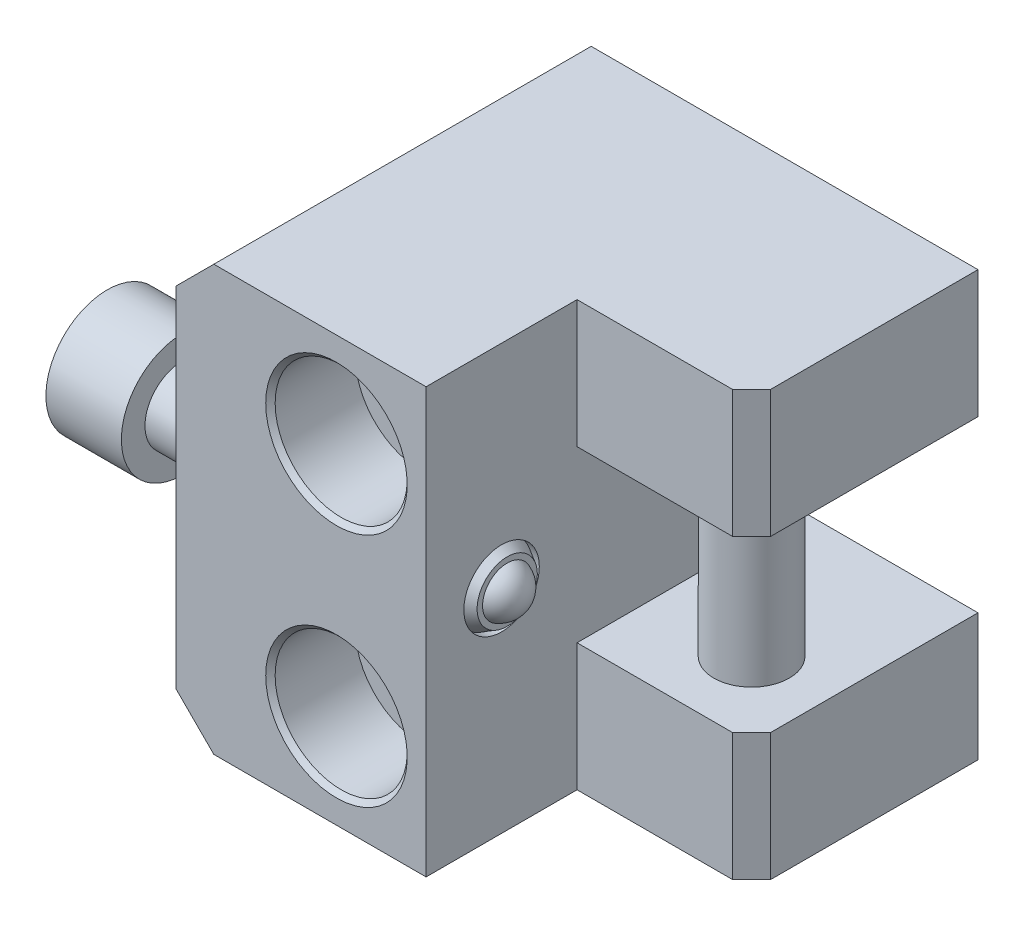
ISO-10303-21;
HEADER;
FILE_DESCRIPTION(('STEP AP214'),'2;1');
FILE_NAME('part.step','',(''),(''),'','','');
FILE_SCHEMA(('AUTOMOTIVE_DESIGN { 1 0 10303 214 1 1 1 1 }'));
ENDSEC;
DATA;
#1=APPLICATION_CONTEXT('core data for automotive mechanical design processes');
#2=APPLICATION_PROTOCOL_DEFINITION('international standard','automotive_design',2000,#1);
#3=PRODUCT_CONTEXT('',#1,'mechanical');
#4=PRODUCT('Part','Part','',(#3));
#5=PRODUCT_RELATED_PRODUCT_CATEGORY('part','',(#4));
#6=PRODUCT_DEFINITION_FORMATION('','',#4);
#7=PRODUCT_DEFINITION_CONTEXT('part definition',#1,'design');
#8=PRODUCT_DEFINITION('design','',#6,#7);
#9=PRODUCT_DEFINITION_SHAPE('','',#8);
#10=(LENGTH_UNIT() NAMED_UNIT(*) SI_UNIT(.MILLI.,.METRE.));
#11=(NAMED_UNIT(*) PLANE_ANGLE_UNIT() SI_UNIT($,.RADIAN.));
#12=(NAMED_UNIT(*) SI_UNIT($,.STERADIAN.) SOLID_ANGLE_UNIT());
#13=UNCERTAINTY_MEASURE_WITH_UNIT(LENGTH_MEASURE(1.E-05),#10,'distance_accuracy_value','');
#14=(GEOMETRIC_REPRESENTATION_CONTEXT(3) GLOBAL_UNCERTAINTY_ASSIGNED_CONTEXT((#13)) GLOBAL_UNIT_ASSIGNED_CONTEXT((#10,
#11,#12)) REPRESENTATION_CONTEXT('',''));
#15=CARTESIAN_POINT('',(0.,0.,0.));
#16=DIRECTION('',(0.,0.,1.));
#17=DIRECTION('',(1.,0.,0.));
#18=AXIS2_PLACEMENT_3D('',#15,#16,#17);
#19=CARTESIAN_POINT('',(-28.3000000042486,10.3571350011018,26.3957043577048));
#20=DIRECTION('',(-1.,-4.10206958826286E-10,0.));
#21=DIRECTION('',(-1.46502879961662E-10,0.357144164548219,0.934049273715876));
#22=AXIS2_PLACEMENT_3D('',#19,#20,#21);
#23=PLANE('',#22);
#24=DIRECTION('',(6.47014759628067E-11,-0.157728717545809,0.987482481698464));
#25=VECTOR('',#24,1.);
#26=CARTESIAN_POINT('',(-28.3000000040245,9.81074669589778,29.8164440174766));
#27=LINE('',#26,#25);
#28=CARTESIAN_POINT('',(-28.3000000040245,9.81074669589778,29.8164440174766));
#29=VERTEX_POINT('',#28);
#30=CARTESIAN_POINT('',(-28.3000000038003,9.26435839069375,33.2371836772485));
#31=VERTEX_POINT('',#30);
#32=EDGE_CURVE('E371',#29,#31,#27,.T.);
#33=ORIENTED_EDGE('',*,*,#32,.T.);
#34=DIRECTION('',(3.18451907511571E-10,-0.776320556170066,-0.630338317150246));
#35=VECTOR('',#34,1.);
#36=CARTESIAN_POINT('',(-28.3000000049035,11.9536116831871,35.4207396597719));
#37=LINE('',#36,#35);
#38=CARTESIAN_POINT('',(-28.3000000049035,11.9536116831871,35.4207396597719));
#39=VERTEX_POINT('',#38);
#40=EDGE_CURVE('E373',#39,#31,#37,.T.);
#41=ORIENTED_EDGE('',*,*,#40,.F.);
#42=DIRECTION('',(3.83153383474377E-10,-0.934049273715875,0.35714416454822));
#43=VECTOR('',#42,1.);
#44=CARTESIAN_POINT('',(-28.3000000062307,15.1892532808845,34.1835559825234));
#45=LINE('',#44,#43);
#46=CARTESIAN_POINT('',(-28.3000000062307,15.1892532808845,34.1835559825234));
#47=VERTEX_POINT('',#46);
#48=EDGE_CURVE('E376',#47,#39,#45,.T.);
#49=ORIENTED_EDGE('',*,*,#48,.F.);
#50=DIRECTION('',(-6.47014759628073E-11,0.157728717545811,-0.987482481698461));
#51=VECTOR('',#50,1.);
#52=CARTESIAN_POINT('',(-28.3000000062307,15.1892532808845,34.1835559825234));
#53=LINE('',#52,#51);
#54=CARTESIAN_POINT('',(-28.3000000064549,15.7356415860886,30.7628163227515));
#55=VERTEX_POINT('',#54);
#56=EDGE_CURVE('E182',#47,#55,#53,.T.);
#57=ORIENTED_EDGE('',*,*,#56,.T.);
#58=DIRECTION('',(-3.1845190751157E-10,0.776320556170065,0.630338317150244));
#59=VECTOR('',#58,1.);
#60=CARTESIAN_POINT('',(-28.3000000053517,13.0463882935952,28.5792603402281));
#61=LINE('',#60,#59);
#62=CARTESIAN_POINT('',(-28.3000000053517,13.0463882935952,28.5792603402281));
#63=VERTEX_POINT('',#62);
#64=EDGE_CURVE('E165',#63,#55,#61,.T.);
#65=ORIENTED_EDGE('',*,*,#64,.F.);
#66=DIRECTION('',(3.83153383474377E-10,-0.934049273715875,0.35714416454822));
#67=VECTOR('',#66,1.);
#68=CARTESIAN_POINT('',(-28.3000000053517,13.0463882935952,28.5792603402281));
#69=LINE('',#68,#67);
#70=EDGE_CURVE('E179',#63,#29,#69,.T.);
#71=ORIENTED_EDGE('',*,*,#70,.T.);
#72=EDGE_LOOP('',(#33,#41,#49,#57,#65,#71));
#73=FACE_BOUND('',#72,.T.);
#74=ADVANCED_FACE('F14',(#73),#23,.T.);
#75=CARTESIAN_POINT('',(-28.3000000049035,11.9536116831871,35.4207396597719));
#76=DIRECTION('',(-2.58569123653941E-10,0.630338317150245,-0.776320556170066));
#77=DIRECTION('',(-3.18451907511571E-10,0.776320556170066,0.630338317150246));
#78=AXIS2_PLACEMENT_3D('',#75,#76,#77);
#79=PLANE('',#78);
#80=ORIENTED_EDGE('',*,*,#40,.T.);
#81=DIRECTION('',(-1.,-4.10206958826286E-10,0.));
#82=VECTOR('',#81,1.);
#83=CARTESIAN_POINT('',(-28.3000000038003,9.26435839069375,33.2371836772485));
#84=LINE('',#83,#82);
#85=CARTESIAN_POINT('',(-32.3000000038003,9.26435838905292,33.2371836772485));
#86=VERTEX_POINT('',#85);
#87=EDGE_CURVE('E186',#31,#86,#84,.T.);
#88=ORIENTED_EDGE('',*,*,#87,.T.);
#89=DIRECTION('',(3.18451907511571E-10,-0.776320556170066,-0.630338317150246));
#90=VECTOR('',#89,1.);
#91=CARTESIAN_POINT('',(-32.3000000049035,11.9536116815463,35.4207396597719));
#92=LINE('',#91,#90);
#93=CARTESIAN_POINT('',(-32.3000000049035,11.9536116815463,35.4207396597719));
#94=VERTEX_POINT('',#93);
#95=EDGE_CURVE('E357',#94,#86,#92,.T.);
#96=ORIENTED_EDGE('',*,*,#95,.F.);
#97=DIRECTION('',(-1.,-4.10206958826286E-10,0.));
#98=VECTOR('',#97,1.);
#99=CARTESIAN_POINT('',(-28.3000000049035,11.9536116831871,35.4207396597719));
#100=LINE('',#99,#98);
#101=EDGE_CURVE('E136',#39,#94,#100,.T.);
#102=ORIENTED_EDGE('',*,*,#101,.F.);
#103=EDGE_LOOP('',(#80,#88,#96,#102));
#104=FACE_BOUND('',#103,.T.);
#105=ADVANCED_FACE('F386',(#104),#79,.T.);
#106=CARTESIAN_POINT('',(-28.3000000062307,15.1892532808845,34.1835559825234));
#107=DIRECTION('',(1.46502879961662E-10,-0.35714416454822,-0.934049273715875));
#108=DIRECTION('',(-3.83153383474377E-10,0.934049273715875,-0.35714416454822));
#109=AXIS2_PLACEMENT_3D('',#106,#107,#108);
#110=PLANE('',#109);
#111=ORIENTED_EDGE('',*,*,#101,.T.);
#112=DIRECTION('',(3.83153383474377E-10,-0.934049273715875,0.35714416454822));
#113=VECTOR('',#112,1.);
#114=CARTESIAN_POINT('',(-32.3000000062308,15.1892532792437,34.1835559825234));
#115=LINE('',#114,#113);
#116=CARTESIAN_POINT('',(-32.3000000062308,15.1892532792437,34.1835559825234));
#117=VERTEX_POINT('',#116);
#118=EDGE_CURVE('E360',#117,#94,#115,.T.);
#119=ORIENTED_EDGE('',*,*,#118,.F.);
#120=DIRECTION('',(-1.,-4.10206958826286E-10,0.));
#121=VECTOR('',#120,1.);
#122=CARTESIAN_POINT('',(-28.3000000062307,15.1892532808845,34.1835559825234));
#123=LINE('',#122,#121);
#124=EDGE_CURVE('E192',#47,#117,#123,.T.);
#125=ORIENTED_EDGE('',*,*,#124,.F.);
#126=ORIENTED_EDGE('',*,*,#48,.T.);
#127=EDGE_LOOP('',(#111,#119,#125,#126));
#128=FACE_BOUND('',#127,.T.);
#129=ADVANCED_FACE('F377',(#128),#110,.T.);
#130=CARTESIAN_POINT('',(-28.3000000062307,15.1892532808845,34.1835559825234));
#131=DIRECTION('',(-4.05072003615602E-10,0.987482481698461,0.157728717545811));
#132=DIRECTION('',(6.47014759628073E-11,-0.157728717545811,0.987482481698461));
#133=AXIS2_PLACEMENT_3D('',#130,#131,#132);
#134=PLANE('',#133);
#135=ORIENTED_EDGE('',*,*,#124,.T.);
#136=DIRECTION('',(-6.47014759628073E-11,0.157728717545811,-0.987482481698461));
#137=VECTOR('',#136,1.);
#138=CARTESIAN_POINT('',(-32.3000000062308,15.1892532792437,34.1835559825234));
#139=LINE('',#138,#137);
#140=CARTESIAN_POINT('',(-32.3000000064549,15.7356415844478,30.7628163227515));
#141=VERTEX_POINT('',#140);
#142=EDGE_CURVE('E365',#117,#141,#139,.T.);
#143=ORIENTED_EDGE('',*,*,#142,.T.);
#144=DIRECTION('',(-1.,-4.10206958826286E-10,0.));
#145=VECTOR('',#144,1.);
#146=CARTESIAN_POINT('',(-28.3000000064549,15.7356415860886,30.7628163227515));
#147=LINE('',#146,#145);
#148=EDGE_CURVE('E173',#55,#141,#147,.T.);
#149=ORIENTED_EDGE('',*,*,#148,.F.);
#150=ORIENTED_EDGE('',*,*,#56,.F.);
#151=EDGE_LOOP('',(#135,#143,#149,#150));
#152=FACE_BOUND('',#151,.T.);
#153=ADVANCED_FACE('F380',(#152),#134,.F.);
#154=CARTESIAN_POINT('',(-28.3000000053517,13.0463882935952,28.5792603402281));
#155=DIRECTION('',(2.58569123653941E-10,-0.630338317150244,0.776320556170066));
#156=DIRECTION('',(3.1845190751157E-10,-0.776320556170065,-0.630338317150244));
#157=AXIS2_PLACEMENT_3D('',#154,#155,#156);
#158=PLANE('',#157);
#159=ORIENTED_EDGE('',*,*,#148,.T.);
#160=DIRECTION('',(-3.1845190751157E-10,0.776320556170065,0.630338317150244));
#161=VECTOR('',#160,1.);
#162=CARTESIAN_POINT('',(-32.3000000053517,13.0463882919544,28.5792603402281));
#163=LINE('',#162,#161);
#164=CARTESIAN_POINT('',(-32.3000000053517,13.0463882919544,28.5792603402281));
#165=VERTEX_POINT('',#164);
#166=EDGE_CURVE('E167',#165,#141,#163,.T.);
#167=ORIENTED_EDGE('',*,*,#166,.F.);
#168=DIRECTION('',(-1.,-4.10206958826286E-10,0.));
#169=VECTOR('',#168,1.);
#170=CARTESIAN_POINT('',(-28.3000000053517,13.0463882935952,28.5792603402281));
#171=LINE('',#170,#169);
#172=EDGE_CURVE('E162',#63,#165,#171,.T.);
#173=ORIENTED_EDGE('',*,*,#172,.F.);
#174=ORIENTED_EDGE('',*,*,#64,.T.);
#175=EDGE_LOOP('',(#159,#167,#173,#174));
#176=FACE_BOUND('',#175,.T.);
#177=ADVANCED_FACE('F164',(#176),#158,.T.);
#178=CARTESIAN_POINT('',(-28.3000000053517,13.0463882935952,28.5792603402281));
#179=DIRECTION('',(1.46502879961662E-10,-0.35714416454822,-0.934049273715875));
#180=DIRECTION('',(-3.83153383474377E-10,0.934049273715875,-0.35714416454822));
#181=AXIS2_PLACEMENT_3D('',#178,#179,#180);
#182=PLANE('',#181);
#183=ORIENTED_EDGE('',*,*,#172,.T.);
#184=DIRECTION('',(3.83153383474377E-10,-0.934049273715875,0.35714416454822));
#185=VECTOR('',#184,1.);
#186=CARTESIAN_POINT('',(-32.3000000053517,13.0463882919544,28.5792603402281));
#187=LINE('',#186,#185);
#188=CARTESIAN_POINT('',(-32.3000000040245,9.81074669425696,29.8164440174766));
#189=VERTEX_POINT('',#188);
#190=EDGE_CURVE('E369',#165,#189,#187,.T.);
#191=ORIENTED_EDGE('',*,*,#190,.T.);
#192=DIRECTION('',(-1.,-4.10206958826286E-10,0.));
#193=VECTOR('',#192,1.);
#194=CARTESIAN_POINT('',(-28.3000000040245,9.81074669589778,29.8164440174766));
#195=LINE('',#194,#193);
#196=EDGE_CURVE('E172',#29,#189,#195,.T.);
#197=ORIENTED_EDGE('',*,*,#196,.F.);
#198=ORIENTED_EDGE('',*,*,#70,.F.);
#199=EDGE_LOOP('',(#183,#191,#197,#198));
#200=FACE_BOUND('',#199,.T.);
#201=ADVANCED_FACE('F184',(#200),#182,.F.);
#202=CARTESIAN_POINT('',(-28.3000000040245,9.81074669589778,29.8164440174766));
#203=DIRECTION('',(4.05072003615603E-10,-0.987482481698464,-0.157728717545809));
#204=DIRECTION('',(-6.47014759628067E-11,0.157728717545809,-0.987482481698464));
#205=AXIS2_PLACEMENT_3D('',#202,#203,#204);
#206=PLANE('',#205);
#207=ORIENTED_EDGE('',*,*,#196,.T.);
#208=DIRECTION('',(6.47014759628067E-11,-0.157728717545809,0.987482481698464));
#209=VECTOR('',#208,1.);
#210=CARTESIAN_POINT('',(-32.3000000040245,9.81074669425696,29.8164440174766));
#211=LINE('',#210,#209);
#212=EDGE_CURVE('E33',#189,#86,#211,.T.);
#213=ORIENTED_EDGE('',*,*,#212,.T.);
#214=ORIENTED_EDGE('',*,*,#87,.F.);
#215=ORIENTED_EDGE('',*,*,#32,.F.);
#216=EDGE_LOOP('',(#207,#213,#214,#215));
#217=FACE_BOUND('',#216,.T.);
#218=ADVANCED_FACE('F387',(#217),#206,.F.);
#219=CARTESIAN_POINT('',(-32.3000000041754,10.178562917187,25.9286797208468));
#220=DIRECTION('',(-1.,-4.10206958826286E-10,0.));
#221=DIRECTION('',(-1.46502879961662E-10,0.357144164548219,0.934049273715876));
#222=AXIS2_PLACEMENT_3D('',#219,#220,#221);
#223=PLANE('',#222);
#224=ORIENTED_EDGE('',*,*,#212,.F.);
#225=ORIENTED_EDGE('',*,*,#190,.F.);
#226=ORIENTED_EDGE('',*,*,#166,.T.);
#227=ORIENTED_EDGE('',*,*,#142,.F.);
#228=ORIENTED_EDGE('',*,*,#118,.T.);
#229=ORIENTED_EDGE('',*,*,#95,.T.);
#230=EDGE_LOOP('',(#224,#225,#226,#227,#228,#229));
#231=FACE_BOUND('',#230,.T.);
#232=CARTESIAN_POINT('',(-32.3000000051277,12.4999999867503,32.));
#233=DIRECTION('',(1.,4.10206958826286E-10,0.));
#234=DIRECTION('',(1.46502879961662E-10,-0.357144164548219,-0.934049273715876));
#235=AXIS2_PLACEMENT_3D('',#232,#233,#234);
#236=CIRCLE('',#235,6.5);
#237=CARTESIAN_POINT('',(-32.3000000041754,10.1785629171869,25.9286797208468));
#238=VERTEX_POINT('',#237);
#239=EDGE_CURVE('E196',#238,#238,#236,.T.);
#240=ORIENTED_EDGE('',*,*,#239,.F.);
#241=EDGE_LOOP('',(#240));
#242=FACE_BOUND('',#241,.T.);
#243=ADVANCED_FACE('F383',(#231,#242),#223,.T.);
#244=CARTESIAN_POINT('',(5.69999999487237,12.5000000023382,32.));
#245=DIRECTION('',(1.,4.10206958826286E-10,0.));
#246=DIRECTION('',(1.46502879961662E-10,-0.357144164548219,-0.934049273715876));
#247=AXIS2_PLACEMENT_3D('',#244,#245,#246);
#248=CYLINDRICAL_SURFACE('',#247,6.5);
#249=ORIENTED_EDGE('',*,*,#239,.T.);
#250=EDGE_LOOP('',(#249));
#251=FACE_BOUND('',#250,.T.);
#252=CARTESIAN_POINT('',(-24.3000000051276,12.499999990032,32.));
#253=DIRECTION('',(1.,4.10206958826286E-10,0.));
#254=DIRECTION('',(1.46502879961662E-10,-0.357144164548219,-0.934049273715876));
#255=AXIS2_PLACEMENT_3D('',#252,#253,#254);
#256=CIRCLE('',#255,6.5);
#257=CARTESIAN_POINT('',(-24.3000000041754,10.1785629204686,25.9286797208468));
#258=VERTEX_POINT('',#257);
#259=EDGE_CURVE('E199',#258,#258,#256,.T.);
#260=ORIENTED_EDGE('',*,*,#259,.F.);
#261=EDGE_LOOP('',(#260));
#262=FACE_BOUND('',#261,.T.);
#263=ADVANCED_FACE('F396',(#251,#262),#248,.T.);
#264=CARTESIAN_POINT('',(-24.3000000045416,11.0714233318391,28.2638029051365));
#265=DIRECTION('',(1.,4.10206958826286E-10,0.));
#266=DIRECTION('',(1.46502879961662E-10,-0.357144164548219,-0.934049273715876));
#267=AXIS2_PLACEMENT_3D('',#264,#265,#266);
#268=PLANE('',#267);
#269=ORIENTED_EDGE('',*,*,#259,.T.);
#270=EDGE_LOOP('',(#269));
#271=FACE_BOUND('',#270,.T.);
#272=CARTESIAN_POINT('',(-24.3000000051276,12.499999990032,32.));
#273=DIRECTION('',(1.,4.10206958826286E-10,0.));
#274=DIRECTION('',(1.46502879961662E-10,-0.357144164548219,-0.934049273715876));
#275=AXIS2_PLACEMENT_3D('',#272,#273,#274);
#276=CIRCLE('',#275,4.);
#277=CARTESIAN_POINT('',(-24.3000000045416,11.0714233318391,28.2638029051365));
#278=VERTEX_POINT('',#277);
#279=EDGE_CURVE('E202',#278,#278,#276,.T.);
#280=ORIENTED_EDGE('',*,*,#279,.F.);
#281=EDGE_LOOP('',(#280));
#282=FACE_BOUND('',#281,.T.);
#283=ADVANCED_FACE('F751',(#271,#282),#268,.T.);
#284=CARTESIAN_POINT('',(5.69999999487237,12.5000000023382,32.));
#285=DIRECTION('',(1.,4.10206958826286E-10,0.));
#286=DIRECTION('',(1.46502879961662E-10,-0.357144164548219,-0.934049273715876));
#287=AXIS2_PLACEMENT_3D('',#284,#285,#286);
#288=CYLINDRICAL_SURFACE('',#287,4.);
#289=ORIENTED_EDGE('',*,*,#279,.T.);
#290=EDGE_LOOP('',(#289));
#291=FACE_BOUND('',#290,.T.);
#292=CARTESIAN_POINT('',(-17.0000000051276,12.4999999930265,32.));
#293=DIRECTION('',(1.,4.10207011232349E-10,0.));
#294=DIRECTION('',(-4.10207011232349E-10,1.,0.));
#295=AXIS2_PLACEMENT_3D('',#292,#293,#294);
#296=CIRCLE('',#295,4.);
#297=CARTESIAN_POINT('',(-17.0000000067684,16.4999999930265,32.));
#298=VERTEX_POINT('',#297);
#299=EDGE_CURVE('E9',#298,#298,#296,.T.);
#300=ORIENTED_EDGE('',*,*,#299,.F.);
#301=EDGE_LOOP('',(#300));
#302=FACE_BOUND('',#301,.T.);
#303=ADVANCED_FACE('F743',(#291,#302),#288,.T.);
#304=CARTESIAN_POINT('',(9.24999999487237,12.5000000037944,32.));
#305=DIRECTION('',(1.,4.10206958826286E-10,0.));
#306=DIRECTION('',(1.46502879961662E-10,-0.357144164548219,-0.934049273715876));
#307=AXIS2_PLACEMENT_3D('',#304,#305,#306);
#308=SPHERICAL_SURFACE('',#307,2.75);
#309=CARTESIAN_POINT('',(10.0983426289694,12.5000000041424,32.));
#310=DIRECTION('',(1.,4.10206958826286E-10,0.));
#311=DIRECTION('',(1.46502879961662E-10,-0.357144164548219,-0.934049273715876));
#312=AXIS2_PLACEMENT_3D('',#309,#310,#311);
#313=CIRCLE('',#312,2.61587743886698);
#314=CARTESIAN_POINT('',(10.0983426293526,11.5657546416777,29.5566415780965));
#315=VERTEX_POINT('',#314);
#316=EDGE_CURVE('E24',#315,#315,#313,.T.);
#317=ORIENTED_EDGE('',*,*,#316,.T.);
#318=EDGE_LOOP('',(#317));
#319=FACE_BOUND('',#318,.T.);
#320=ADVANCED_FACE('F735',(#319),#308,.T.);
#321=CARTESIAN_POINT('',(10.098342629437,11.3600995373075,29.0187859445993));
#322=DIRECTION('',(-1.,-4.10206958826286E-10,0.));
#323=DIRECTION('',(-1.46502879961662E-10,0.357144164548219,0.934049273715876));
#324=AXIS2_PLACEMENT_3D('',#321,#322,#323);
#325=PLANE('',#324);
#326=ORIENTED_EDGE('',*,*,#316,.F.);
#327=EDGE_LOOP('',(#326));
#328=FACE_BOUND('',#327,.T.);
#329=CARTESIAN_POINT('',(10.0983426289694,12.5000000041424,32.));
#330=DIRECTION('',(1.,4.10206958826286E-10,0.));
#331=DIRECTION('',(1.46502879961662E-10,-0.357144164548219,-0.934049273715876));
#332=AXIS2_PLACEMENT_3D('',#329,#330,#331);
#333=CIRCLE('',#332,3.19170962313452);
#334=CARTESIAN_POINT('',(10.098342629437,11.3600995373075,29.0187859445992));
#335=VERTEX_POINT('',#334);
#336=EDGE_CURVE('E208',#335,#335,#333,.T.);
#337=ORIENTED_EDGE('',*,*,#336,.T.);
#338=EDGE_LOOP('',(#337));
#339=FACE_BOUND('',#338,.T.);
#340=ADVANCED_FACE('F416',(#328,#339),#325,.F.);
#341=CARTESIAN_POINT('',(8.69834262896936,12.5000000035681,32.));
#342=DIRECTION('',(-1.,-4.10206958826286E-10,0.));
#343=DIRECTION('',(-1.46502879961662E-10,0.357144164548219,0.934049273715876));
#344=AXIS2_PLACEMENT_3D('',#341,#342,#343);
#345=CONICAL_SURFACE('',#344,4.,0.523598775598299);
#346=ORIENTED_EDGE('',*,*,#336,.F.);
#347=EDGE_LOOP('',(#346));
#348=FACE_BOUND('',#347,.T.);
#349=CARTESIAN_POINT('',(8.69834262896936,12.5000000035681,32.));
#350=DIRECTION('',(1.,4.10206958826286E-10,0.));
#351=DIRECTION('',(1.46502879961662E-10,-0.357144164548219,-0.934049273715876));
#352=AXIS2_PLACEMENT_3D('',#349,#350,#351);
#353=CIRCLE('',#352,4.);
#354=CARTESIAN_POINT('',(8.69834262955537,11.0714233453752,28.2638029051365));
#355=VERTEX_POINT('',#354);
#356=EDGE_CURVE('E205',#355,#355,#353,.T.);
#357=ORIENTED_EDGE('',*,*,#356,.T.);
#358=EDGE_LOOP('',(#357));
#359=FACE_BOUND('',#358,.T.);
#360=ADVANCED_FACE('F404',(#348,#359),#345,.T.);
#361=CARTESIAN_POINT('',(-7.00000001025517,24.9999999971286,30.997116));
#362=DIRECTION('',(0.,0.,-1.));
#363=DIRECTION('',(1.,4.10206857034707E-10,0.));
#364=AXIS2_PLACEMENT_3D('',#361,#362,#363);
#365=PLANE('',#364);
#366=CARTESIAN_POINT('',(-1.0255171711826E-08,25.,30.997116));
#367=DIRECTION('',(0.,0.,1.));
#368=DIRECTION('',(-1.,-4.10206857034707E-10,0.));
#369=AXIS2_PLACEMENT_3D('',#366,#367,#368);
#370=CIRCLE('',#369,4.25);
#371=CARTESIAN_POINT('',(-4.25000001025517,24.9999999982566,30.997116));
#372=VERTEX_POINT('',#371);
#373=EDGE_CURVE('E269',#372,#372,#370,.T.);
#374=ORIENTED_EDGE('',*,*,#373,.F.);
#375=EDGE_LOOP('',(#374));
#376=FACE_BOUND('',#375,.T.);
#377=CARTESIAN_POINT('',(-1.0255171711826E-08,25.,30.997116));
#378=DIRECTION('',(0.,0.,1.));
#379=DIRECTION('',(-1.,-4.10206857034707E-10,0.));
#380=AXIS2_PLACEMENT_3D('',#377,#378,#379);
#381=CIRCLE('',#380,7.);
#382=CARTESIAN_POINT('',(-7.00000001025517,24.9999999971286,30.997116));
#383=VERTEX_POINT('',#382);
#384=EDGE_CURVE('E266',#383,#383,#381,.T.);
#385=ORIENTED_EDGE('',*,*,#384,.T.);
#386=EDGE_LOOP('',(#385));
#387=FACE_BOUND('',#386,.T.);
#388=ADVANCED_FACE('F401',(#376,#387),#365,.F.);
#389=CARTESIAN_POINT('',(-7.,-2.87144093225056E-09,30.997116));
#390=DIRECTION('',(0.,0.,-1.));
#391=DIRECTION('',(1.,4.10206857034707E-10,0.));
#392=AXIS2_PLACEMENT_3D('',#389,#390,#391);
#393=PLANE('',#392);
#394=CARTESIAN_POINT('',(0.,0.,30.997116));
#395=DIRECTION('',(0.,0.,1.));
#396=DIRECTION('',(-1.,-4.10206857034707E-10,0.));
#397=AXIS2_PLACEMENT_3D('',#394,#395,#396);
#398=CIRCLE('',#397,4.25);
#399=CARTESIAN_POINT('',(-4.25,-1.7433722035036E-09,30.997116));
#400=VERTEX_POINT('',#399);
#401=EDGE_CURVE('E251',#400,#400,#398,.T.);
#402=ORIENTED_EDGE('',*,*,#401,.F.);
#403=EDGE_LOOP('',(#402));
#404=FACE_BOUND('',#403,.T.);
#405=CARTESIAN_POINT('',(0.,0.,30.997116));
#406=DIRECTION('',(0.,0.,1.));
#407=DIRECTION('',(-1.,-4.10206857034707E-10,0.));
#408=AXIS2_PLACEMENT_3D('',#405,#406,#407);
#409=CIRCLE('',#408,7.);
#410=CARTESIAN_POINT('',(-7.,-2.87144106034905E-09,30.997116));
#411=VERTEX_POINT('',#410);
#412=EDGE_CURVE('E248',#411,#411,#409,.T.);
#413=ORIENTED_EDGE('',*,*,#412,.T.);
#414=EDGE_LOOP('',(#413));
#415=FACE_BOUND('',#414,.T.);
#416=ADVANCED_FACE('F403',(#404,#415),#393,.F.);
#417=CARTESIAN_POINT('',(19.9999999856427,35.0000000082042,16.));
#418=DIRECTION('',(4.10206948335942E-10,-1.,0.));
#419=DIRECTION('',(1.,4.10206948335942E-10,0.));
#420=AXIS2_PLACEMENT_3D('',#417,#418,#419);
#421=CYLINDRICAL_SURFACE('',#420,4.);
#422=CARTESIAN_POINT('',(19.9999999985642,3.50000000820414,16.));
#423=DIRECTION('',(4.10207011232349E-10,-1.,0.));
#424=DIRECTION('',(1.,4.10207011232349E-10,0.));
#425=AXIS2_PLACEMENT_3D('',#422,#423,#424);
#426=CIRCLE('',#425,4.);
#427=CARTESIAN_POINT('',(23.9999999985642,3.50000000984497,16.));
#428=VERTEX_POINT('',#427);
#429=EDGE_CURVE('E245',#428,#428,#426,.F.);
#430=ORIENTED_EDGE('',*,*,#429,.T.);
#431=EDGE_LOOP('',(#430));
#432=FACE_BOUND('',#431,.T.);
#433=CARTESIAN_POINT('',(19.9999999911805,21.5000000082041,16.));
#434=DIRECTION('',(-4.10207011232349E-10,1.,0.));
#435=DIRECTION('',(-1.,-4.10207011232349E-10,0.));
#436=AXIS2_PLACEMENT_3D('',#433,#434,#435);
#437=CIRCLE('',#436,4.);
#438=CARTESIAN_POINT('',(15.9999999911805,21.5000000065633,16.));
#439=VERTEX_POINT('',#438);
#440=EDGE_CURVE('E240',#439,#439,#437,.F.);
#441=ORIENTED_EDGE('',*,*,#440,.T.);
#442=EDGE_LOOP('',(#441));
#443=FACE_BOUND('',#442,.T.);
#444=ADVANCED_FACE('F412',(#432,#443),#421,.T.);
#445=CARTESIAN_POINT('',(-1.0255171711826E-08,25.,40.));
#446=DIRECTION('',(0.,0.,1.));
#447=DIRECTION('',(-1.,-4.10206857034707E-10,0.));
#448=AXIS2_PLACEMENT_3D('',#445,#446,#447);
#449=CYLINDRICAL_SURFACE('',#448,4.25);
#450=CARTESIAN_POINT('',(-1.0255171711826E-08,25.,0.499999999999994));
#451=DIRECTION('',(0.,0.,1.));
#452=DIRECTION('',(-1.,-4.10206857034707E-10,0.));
#453=AXIS2_PLACEMENT_3D('',#450,#451,#452);
#454=CIRCLE('',#453,4.25);
#455=CARTESIAN_POINT('',(-4.25000001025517,24.9999999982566,0.499999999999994));
#456=VERTEX_POINT('',#455);
#457=EDGE_CURVE('E272',#456,#456,#454,.T.);
#458=ORIENTED_EDGE('',*,*,#457,.F.);
#459=EDGE_LOOP('',(#458));
#460=FACE_BOUND('',#459,.T.);
#461=ORIENTED_EDGE('',*,*,#373,.T.);
#462=EDGE_LOOP('',(#461));
#463=FACE_BOUND('',#462,.T.);
#464=ADVANCED_FACE('F424',(#460,#463),#449,.F.);
#465=CARTESIAN_POINT('',(0.,0.,40.));
#466=DIRECTION('',(0.,0.,1.));
#467=DIRECTION('',(-1.,-4.10206857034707E-10,0.));
#468=AXIS2_PLACEMENT_3D('',#465,#466,#467);
#469=CYLINDRICAL_SURFACE('',#468,4.25);
#470=CARTESIAN_POINT('',(0.,0.,0.499999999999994));
#471=DIRECTION('',(0.,0.,1.));
#472=DIRECTION('',(-1.,-4.10206857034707E-10,0.));
#473=AXIS2_PLACEMENT_3D('',#470,#471,#472);
#474=CIRCLE('',#473,4.25);
#475=CARTESIAN_POINT('',(-4.25,-1.7433722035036E-09,0.499999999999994));
#476=VERTEX_POINT('',#475);
#477=EDGE_CURVE('E254',#476,#476,#474,.T.);
#478=ORIENTED_EDGE('',*,*,#477,.F.);
#479=EDGE_LOOP('',(#478));
#480=FACE_BOUND('',#479,.T.);
#481=ORIENTED_EDGE('',*,*,#401,.T.);
#482=EDGE_LOOP('',(#481));
#483=FACE_BOUND('',#482,.T.);
#484=ADVANCED_FACE('F427',(#480,#483),#469,.F.);
#485=CARTESIAN_POINT('',(25.9999999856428,35.0000000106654,24.));
#486=DIRECTION('',(0.707106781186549,2.90060159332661E-10,0.707106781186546));
#487=DIRECTION('',(-0.707106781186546,-2.90060050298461E-10,0.707106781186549));
#488=AXIS2_PLACEMENT_3D('',#485,#486,#487);
#489=PLANE('',#488);
#490=DIRECTION('',(-0.707106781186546,-2.90060050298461E-10,0.707106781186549));
#491=VECTOR('',#490,1.);
#492=CARTESIAN_POINT('',(26.000000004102,-9.99999998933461,24.));
#493=LINE('',#492,#491);
#494=CARTESIAN_POINT('',(28.000000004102,-9.9999999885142,22.));
#495=VERTEX_POINT('',#494);
#496=CARTESIAN_POINT('',(26.000000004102,-9.99999998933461,24.));
#497=VERTEX_POINT('',#496);
#498=EDGE_CURVE('E18',#495,#497,#493,.T.);
#499=ORIENTED_EDGE('',*,*,#498,.F.);
#500=DIRECTION('',(4.10207011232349E-10,-1.,0.));
#501=VECTOR('',#500,1.);
#502=CARTESIAN_POINT('',(28.000000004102,-9.9999999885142,22.));
#503=LINE('',#502,#501);
#504=CARTESIAN_POINT('',(27.9999999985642,3.5000000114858,22.));
#505=VERTEX_POINT('',#504);
#506=EDGE_CURVE('E127',#505,#495,#503,.T.);
#507=ORIENTED_EDGE('',*,*,#506,.F.);
#508=DIRECTION('',(0.707106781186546,2.90060108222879E-10,-0.707106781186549));
#509=VECTOR('',#508,1.);
#510=CARTESIAN_POINT('',(25.9999999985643,3.50000001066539,24.));
#511=LINE('',#510,#509);
#512=CARTESIAN_POINT('',(25.9999999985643,3.50000001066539,24.));
#513=VERTEX_POINT('',#512);
#514=EDGE_CURVE('E121',#513,#505,#511,.T.);
#515=ORIENTED_EDGE('',*,*,#514,.F.);
#516=DIRECTION('',(-4.10207011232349E-10,1.,0.));
#517=VECTOR('',#516,1.);
#518=CARTESIAN_POINT('',(25.9999999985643,3.50000001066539,24.));
#519=LINE('',#518,#517);
#520=EDGE_CURVE('E351',#497,#513,#519,.T.);
#521=ORIENTED_EDGE('',*,*,#520,.F.);
#522=EDGE_LOOP('',(#499,#507,#515,#521));
#523=FACE_BOUND('',#522,.T.);
#524=ADVANCED_FACE('F456',(#523),#489,.T.);
#525=CARTESIAN_POINT('',(25.9999999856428,35.0000000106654,24.));
#526=DIRECTION('',(0.707106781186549,2.90060159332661E-10,0.707106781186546));
#527=DIRECTION('',(-0.707106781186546,-2.90060050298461E-10,0.707106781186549));
#528=AXIS2_PLACEMENT_3D('',#525,#526,#527);
#529=PLANE('',#528);
#530=DIRECTION('',(-0.707106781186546,-2.9006021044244E-10,0.707106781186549));
#531=VECTOR('',#530,1.);
#532=CARTESIAN_POINT('',(25.9999999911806,21.5000000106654,24.));
#533=LINE('',#532,#531);
#534=CARTESIAN_POINT('',(27.9999999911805,21.5000000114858,22.));
#535=VERTEX_POINT('',#534);
#536=CARTESIAN_POINT('',(25.9999999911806,21.5000000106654,24.));
#537=VERTEX_POINT('',#536);
#538=EDGE_CURVE('E349',#535,#537,#533,.T.);
#539=ORIENTED_EDGE('',*,*,#538,.F.);
#540=DIRECTION('',(4.10207011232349E-10,-1.,0.));
#541=VECTOR('',#540,1.);
#542=CARTESIAN_POINT('',(27.9999999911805,21.5000000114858,22.));
#543=LINE('',#542,#541);
#544=CARTESIAN_POINT('',(27.9999999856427,35.0000000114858,22.));
#545=VERTEX_POINT('',#544);
#546=EDGE_CURVE('E347',#545,#535,#543,.T.);
#547=ORIENTED_EDGE('',*,*,#546,.F.);
#548=DIRECTION('',(0.707106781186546,2.90060050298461E-10,-0.707106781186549));
#549=VECTOR('',#548,1.);
#550=CARTESIAN_POINT('',(25.9999999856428,35.0000000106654,24.));
#551=LINE('',#550,#549);
#552=CARTESIAN_POINT('',(25.9999999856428,35.0000000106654,24.));
#553=VERTEX_POINT('',#552);
#554=EDGE_CURVE('E345',#553,#545,#551,.T.);
#555=ORIENTED_EDGE('',*,*,#554,.F.);
#556=DIRECTION('',(-4.10207011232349E-10,1.,0.));
#557=VECTOR('',#556,1.);
#558=CARTESIAN_POINT('',(25.9999999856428,35.0000000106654,24.));
#559=LINE('',#558,#557);
#560=EDGE_CURVE('E338',#537,#553,#559,.T.);
#561=ORIENTED_EDGE('',*,*,#560,.F.);
#562=EDGE_LOOP('',(#539,#547,#555,#561));
#563=FACE_BOUND('',#562,.T.);
#564=ADVANCED_FACE('F429',(#563),#529,.T.);
#565=CARTESIAN_POINT('',(-1.0255171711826E-08,25.,40.));
#566=DIRECTION('',(0.,0.,1.));
#567=DIRECTION('',(-1.,-4.10206857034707E-10,0.));
#568=AXIS2_PLACEMENT_3D('',#565,#566,#567);
#569=CYLINDRICAL_SURFACE('',#568,7.);
#570=ORIENTED_EDGE('',*,*,#384,.F.);
#571=EDGE_LOOP('',(#570));
#572=FACE_BOUND('',#571,.T.);
#573=CARTESIAN_POINT('',(-1.0255171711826E-08,25.,39.5));
#574=DIRECTION('',(0.,0.,1.));
#575=DIRECTION('',(-1.,-4.10206857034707E-10,0.));
#576=AXIS2_PLACEMENT_3D('',#573,#574,#575);
#577=CIRCLE('',#576,7.);
#578=CARTESIAN_POINT('',(-7.00000001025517,24.9999999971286,39.5));
#579=VERTEX_POINT('',#578);
#580=EDGE_CURVE('E263',#579,#579,#577,.T.);
#581=ORIENTED_EDGE('',*,*,#580,.T.);
#582=EDGE_LOOP('',(#581));
#583=FACE_BOUND('',#582,.T.);
#584=ADVANCED_FACE('F415',(#572,#583),#569,.F.);
#585=CARTESIAN_POINT('',(0.,0.,40.));
#586=DIRECTION('',(0.,0.,1.));
#587=DIRECTION('',(-1.,-4.10206857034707E-10,0.));
#588=AXIS2_PLACEMENT_3D('',#585,#586,#587);
#589=CYLINDRICAL_SURFACE('',#588,7.);
#590=ORIENTED_EDGE('',*,*,#412,.F.);
#591=EDGE_LOOP('',(#590));
#592=FACE_BOUND('',#591,.T.);
#593=CARTESIAN_POINT('',(0.,0.,39.5));
#594=DIRECTION('',(0.,0.,1.));
#595=DIRECTION('',(-1.,-4.10206857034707E-10,0.));
#596=AXIS2_PLACEMENT_3D('',#593,#594,#595);
#597=CIRCLE('',#596,7.);
#598=CARTESIAN_POINT('',(-7.,-2.87144106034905E-09,39.5));
#599=VERTEX_POINT('',#598);
#600=EDGE_CURVE('E244',#599,#599,#597,.T.);
#601=ORIENTED_EDGE('',*,*,#600,.T.);
#602=EDGE_LOOP('',(#601));
#603=FACE_BOUND('',#602,.T.);
#604=ADVANCED_FACE('F441',(#592,#603),#589,.F.);
#605=CARTESIAN_POINT('',(27.9999999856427,35.0000000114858,24.));
#606=DIRECTION('',(0.,0.,1.));
#607=DIRECTION('',(-1.,-4.10206857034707E-10,0.));
#608=AXIS2_PLACEMENT_3D('',#605,#606,#607);
#609=PLANE('',#608);
#610=DIRECTION('',(1.,4.10207011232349E-10,0.));
#611=VECTOR('',#610,1.);
#612=CARTESIAN_POINT('',(-20.5000000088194,21.4999999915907,24.));
#613=LINE('',#612,#611);
#614=CARTESIAN_POINT('',(9.49999999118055,21.5000000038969,24.));
#615=VERTEX_POINT('',#614);
#616=EDGE_CURVE('E228',#615,#537,#613,.T.);
#617=ORIENTED_EDGE('',*,*,#616,.T.);
#618=ORIENTED_EDGE('',*,*,#560,.T.);
#619=DIRECTION('',(-1.,-4.10206857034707E-10,0.));
#620=VECTOR('',#619,1.);
#621=CARTESIAN_POINT('',(27.9999999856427,35.0000000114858,24.));
#622=LINE('',#621,#620);
#623=CARTESIAN_POINT('',(9.49999998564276,35.000000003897,24.));
#624=VERTEX_POINT('',#623);
#625=EDGE_CURVE('E281',#553,#624,#622,.T.);
#626=ORIENTED_EDGE('',*,*,#625,.T.);
#627=DIRECTION('',(4.10207011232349E-10,-1.,0.));
#628=VECTOR('',#627,1.);
#629=CARTESIAN_POINT('',(9.50000000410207,-9.99999999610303,24.));
#630=LINE('',#629,#628);
#631=EDGE_CURVE('E284',#624,#615,#630,.T.);
#632=ORIENTED_EDGE('',*,*,#631,.T.);
#633=EDGE_LOOP('',(#617,#618,#626,#632));
#634=FACE_BOUND('',#633,.T.);
#635=ADVANCED_FACE('F437',(#634),#609,.T.);
#636=DIRECTION('',(1.,4.10206669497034E-10,0.));
#637=VECTOR('',#636,1.);
#638=CARTESIAN_POINT('',(28.000000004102,-9.9999999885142,24.));
#639=LINE('',#638,#637);
#640=CARTESIAN_POINT('',(9.50000000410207,-9.99999999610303,24.));
#641=VERTEX_POINT('',#640);
#642=EDGE_CURVE('E287',#641,#497,#639,.T.);
#643=ORIENTED_EDGE('',*,*,#642,.T.);
#644=ORIENTED_EDGE('',*,*,#520,.T.);
#645=DIRECTION('',(1.,4.10207011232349E-10,0.));
#646=VECTOR('',#645,1.);
#647=CARTESIAN_POINT('',(-20.5000000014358,3.49999999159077,24.));
#648=LINE('',#647,#646);
#649=CARTESIAN_POINT('',(9.49999999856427,3.50000000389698,24.));
#650=VERTEX_POINT('',#649);
#651=EDGE_CURVE('E235',#650,#513,#648,.T.);
#652=ORIENTED_EDGE('',*,*,#651,.F.);
#653=EDGE_CURVE('E283',#650,#641,#630,.T.);
#654=ORIENTED_EDGE('',*,*,#653,.T.);
#655=EDGE_LOOP('',(#643,#644,#652,#654));
#656=FACE_BOUND('',#655,.T.);
#657=ADVANCED_FACE('F440',(#656),#609,.T.);
#658=CARTESIAN_POINT('',(-20.5000000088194,21.4999999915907,24.));
#659=DIRECTION('',(-4.10207011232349E-10,1.,0.));
#660=DIRECTION('',(-1.,-4.10207011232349E-10,0.));
#661=AXIS2_PLACEMENT_3D('',#658,#659,#660);
#662=PLANE('',#661);
#663=DIRECTION('',(0.,0.,1.));
#664=VECTOR('',#663,1.);
#665=CARTESIAN_POINT('',(27.9999999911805,21.5000000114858,24.));
#666=LINE('',#665,#664);
#667=CARTESIAN_POINT('',(27.9999999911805,21.5000000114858,0.));
#668=VERTEX_POINT('',#667);
#669=EDGE_CURVE('E217',#668,#535,#666,.T.);
#670=ORIENTED_EDGE('',*,*,#669,.T.);
#671=ORIENTED_EDGE('',*,*,#538,.T.);
#672=ORIENTED_EDGE('',*,*,#616,.F.);
#673=DIRECTION('',(0.,0.,1.));
#674=VECTOR('',#673,1.);
#675=CARTESIAN_POINT('',(9.49999999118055,21.5000000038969,24.));
#676=LINE('',#675,#674);
#677=CARTESIAN_POINT('',(9.49999999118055,21.5000000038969,0.));
#678=VERTEX_POINT('',#677);
#679=EDGE_CURVE('E225',#678,#615,#676,.T.);
#680=ORIENTED_EDGE('',*,*,#679,.F.);
#681=DIRECTION('',(1.,4.10207011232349E-10,0.));
#682=VECTOR('',#681,1.);
#683=CARTESIAN_POINT('',(-20.5000000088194,21.4999999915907,0.));
#684=LINE('',#683,#682);
#685=EDGE_CURVE('E229',#678,#668,#684,.T.);
#686=ORIENTED_EDGE('',*,*,#685,.T.);
#687=EDGE_LOOP('',(#670,#671,#672,#680,#686));
#688=FACE_BOUND('',#687,.T.);
#689=ORIENTED_EDGE('',*,*,#440,.F.);
#690=EDGE_LOOP('',(#689));
#691=FACE_BOUND('',#690,.T.);
#692=ADVANCED_FACE('F471',(#688,#691),#662,.F.);
#693=CARTESIAN_POINT('',(27.9999999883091,28.5000000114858,16.));
#694=DIRECTION('',(1.,4.10206857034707E-10,0.));
#695=DIRECTION('',(0.,0.,1.));
#696=AXIS2_PLACEMENT_3D('',#693,#694,#695);
#697=PLANE('',#696);
#698=DIRECTION('',(0.,0.,-1.));
#699=VECTOR('',#698,1.);
#700=CARTESIAN_POINT('',(27.9999999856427,35.0000000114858,40.));
#701=LINE('',#700,#699);
#702=CARTESIAN_POINT('',(27.9999999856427,35.0000000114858,0.));
#703=VERTEX_POINT('',#702);
#704=EDGE_CURVE('E318',#545,#703,#701,.T.);
#705=ORIENTED_EDGE('',*,*,#704,.F.);
#706=ORIENTED_EDGE('',*,*,#546,.T.);
#707=ORIENTED_EDGE('',*,*,#669,.F.);
#708=DIRECTION('',(-4.10207011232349E-10,1.,0.));
#709=VECTOR('',#708,1.);
#710=CARTESIAN_POINT('',(28.000000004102,-9.9999999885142,0.));
#711=LINE('',#710,#709);
#712=EDGE_CURVE('E294',#668,#703,#711,.T.);
#713=ORIENTED_EDGE('',*,*,#712,.T.);
#714=EDGE_LOOP('',(#705,#706,#707,#713));
#715=FACE_BOUND('',#714,.T.);
#716=ADVANCED_FACE('F16',(#715),#697,.T.);
#717=CARTESIAN_POINT('',(28.000000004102,-9.9999999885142,40.));
#718=DIRECTION('',(-1.,-4.10207011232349E-10,0.));
#719=DIRECTION('',(4.10207011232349E-10,-1.,0.));
#720=AXIS2_PLACEMENT_3D('',#717,#718,#719);
#721=PLANE('',#720);
#722=DIRECTION('',(0.,0.,-1.));
#723=VECTOR('',#722,1.);
#724=CARTESIAN_POINT('',(27.9999999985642,3.5000000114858,24.));
#725=LINE('',#724,#723);
#726=CARTESIAN_POINT('',(27.9999999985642,3.5000000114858,0.));
#727=VERTEX_POINT('',#726);
#728=EDGE_CURVE('E216',#505,#727,#725,.T.);
#729=ORIENTED_EDGE('',*,*,#728,.F.);
#730=ORIENTED_EDGE('',*,*,#506,.T.);
#731=DIRECTION('',(0.,0.,-1.));
#732=VECTOR('',#731,1.);
#733=CARTESIAN_POINT('',(28.000000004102,-9.9999999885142,40.));
#734=LINE('',#733,#732);
#735=CARTESIAN_POINT('',(28.000000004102,-9.9999999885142,0.));
#736=VERTEX_POINT('',#735);
#737=EDGE_CURVE('E316',#495,#736,#734,.T.);
#738=ORIENTED_EDGE('',*,*,#737,.T.);
#739=EDGE_CURVE('E296',#736,#727,#711,.T.);
#740=ORIENTED_EDGE('',*,*,#739,.T.);
#741=EDGE_LOOP('',(#729,#730,#738,#740));
#742=FACE_BOUND('',#741,.T.);
#743=ADVANCED_FACE('F464',(#742),#721,.F.);
#744=CARTESIAN_POINT('',(-20.5000000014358,3.49999999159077,24.));
#745=DIRECTION('',(4.10207011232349E-10,-1.,0.));
#746=DIRECTION('',(1.,4.10207011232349E-10,0.));
#747=AXIS2_PLACEMENT_3D('',#744,#745,#746);
#748=PLANE('',#747);
#749=ORIENTED_EDGE('',*,*,#651,.T.);
#750=ORIENTED_EDGE('',*,*,#514,.T.);
#751=ORIENTED_EDGE('',*,*,#728,.T.);
#752=DIRECTION('',(1.,4.10207011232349E-10,0.));
#753=VECTOR('',#752,1.);
#754=CARTESIAN_POINT('',(-20.5000000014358,3.49999999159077,0.));
#755=LINE('',#754,#753);
#756=CARTESIAN_POINT('',(9.49999999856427,3.50000000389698,0.));
#757=VERTEX_POINT('',#756);
#758=EDGE_CURVE('E224',#757,#727,#755,.T.);
#759=ORIENTED_EDGE('',*,*,#758,.F.);
#760=DIRECTION('',(0.,0.,-1.));
#761=VECTOR('',#760,1.);
#762=CARTESIAN_POINT('',(9.49999999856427,3.50000000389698,24.));
#763=LINE('',#762,#761);
#764=EDGE_CURVE('E220',#650,#757,#763,.T.);
#765=ORIENTED_EDGE('',*,*,#764,.F.);
#766=EDGE_LOOP('',(#749,#750,#751,#759,#765));
#767=FACE_BOUND('',#766,.T.);
#768=ORIENTED_EDGE('',*,*,#429,.F.);
#769=EDGE_LOOP('',(#768));
#770=FACE_BOUND('',#769,.T.);
#771=ADVANCED_FACE('F434',(#767,#770),#748,.F.);
#772=CARTESIAN_POINT('',(-1.0255171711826E-08,25.,0.499999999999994));
#773=DIRECTION('',(0.,0.,-1.));
#774=DIRECTION('',(1.,4.10206857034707E-10,0.));
#775=AXIS2_PLACEMENT_3D('',#772,#773,#774);
#776=CONICAL_SURFACE('',#775,4.25,0.785398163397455);
#777=CARTESIAN_POINT('',(-1.0255171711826E-08,25.,0.));
#778=DIRECTION('',(0.,0.,1.));
#779=DIRECTION('',(-1.,-4.10206857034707E-10,0.));
#780=AXIS2_PLACEMENT_3D('',#777,#778,#779);
#781=CIRCLE('',#780,4.75);
#782=CARTESIAN_POINT('',(-4.75000001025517,24.9999999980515,0.));
#783=VERTEX_POINT('',#782);
#784=EDGE_CURVE('E275',#783,#783,#781,.T.);
#785=ORIENTED_EDGE('',*,*,#784,.F.);
#786=EDGE_LOOP('',(#785));
#787=FACE_BOUND('',#786,.T.);
#788=ORIENTED_EDGE('',*,*,#457,.T.);
#789=EDGE_LOOP('',(#788));
#790=FACE_BOUND('',#789,.T.);
#791=ADVANCED_FACE('F430',(#787,#790),#776,.F.);
#792=CARTESIAN_POINT('',(0.,0.,0.499999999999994));
#793=DIRECTION('',(0.,0.,-1.));
#794=DIRECTION('',(1.,4.10206857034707E-10,0.));
#795=AXIS2_PLACEMENT_3D('',#792,#793,#794);
#796=CONICAL_SURFACE('',#795,4.25,0.785398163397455);
#797=CARTESIAN_POINT('',(0.,0.,0.));
#798=DIRECTION('',(0.,0.,1.));
#799=DIRECTION('',(-1.,-4.10206857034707E-10,0.));
#800=AXIS2_PLACEMENT_3D('',#797,#798,#799);
#801=CIRCLE('',#800,4.75);
#802=CARTESIAN_POINT('',(-4.75,-1.94847563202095E-09,0.));
#803=VERTEX_POINT('',#802);
#804=EDGE_CURVE('E257',#803,#803,#801,.T.);
#805=ORIENTED_EDGE('',*,*,#804,.F.);
#806=EDGE_LOOP('',(#805));
#807=FACE_BOUND('',#806,.T.);
#808=ORIENTED_EDGE('',*,*,#477,.T.);
#809=EDGE_LOOP('',(#808));
#810=FACE_BOUND('',#809,.T.);
#811=ADVANCED_FACE('F433',(#807,#810),#796,.F.);
#812=CARTESIAN_POINT('',(9.50000000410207,-9.99999999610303,24.));
#813=DIRECTION('',(-1.,-4.10207011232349E-10,0.));
#814=DIRECTION('',(4.10207011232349E-10,-1.,0.));
#815=AXIS2_PLACEMENT_3D('',#812,#813,#814);
#816=PLANE('',#815);
#817=CARTESIAN_POINT('',(9.49999999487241,12.500000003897,32.));
#818=DIRECTION('',(-1.,-4.10207011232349E-10,0.));
#819=DIRECTION('',(4.10207011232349E-10,-1.,0.));
#820=AXIS2_PLACEMENT_3D('',#817,#818,#819);
#821=CIRCLE('',#820,4.);
#822=CARTESIAN_POINT('',(9.49999999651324,8.50000000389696,32.));
#823=VERTEX_POINT('',#822);
#824=EDGE_CURVE('E213',#823,#823,#821,.T.);
#825=ORIENTED_EDGE('',*,*,#824,.T.);
#826=EDGE_LOOP('',(#825));
#827=FACE_BOUND('',#826,.T.);
#828=DIRECTION('',(4.10207011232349E-10,-1.,0.));
#829=VECTOR('',#828,1.);
#830=CARTESIAN_POINT('',(9.50000000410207,-9.99999999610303,40.));
#831=LINE('',#830,#829);
#832=CARTESIAN_POINT('',(9.49999998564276,35.000000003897,40.));
#833=VERTEX_POINT('',#832);
#834=CARTESIAN_POINT('',(9.50000000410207,-9.99999999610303,40.));
#835=VERTEX_POINT('',#834);
#836=EDGE_CURVE('E278',#833,#835,#831,.T.);
#837=ORIENTED_EDGE('',*,*,#836,.T.);
#838=DIRECTION('',(0.,0.,1.));
#839=VECTOR('',#838,1.);
#840=CARTESIAN_POINT('',(9.50000000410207,-9.99999999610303,24.));
#841=LINE('',#840,#839);
#842=EDGE_CURVE('E291',#641,#835,#841,.T.);
#843=ORIENTED_EDGE('',*,*,#842,.F.);
#844=ORIENTED_EDGE('',*,*,#653,.F.);
#845=ORIENTED_EDGE('',*,*,#764,.T.);
#846=DIRECTION('',(-4.10207011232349E-10,1.,0.));
#847=VECTOR('',#846,1.);
#848=CARTESIAN_POINT('',(9.49999999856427,3.50000000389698,0.));
#849=LINE('',#848,#847);
#850=EDGE_CURVE('E230',#757,#678,#849,.T.);
#851=ORIENTED_EDGE('',*,*,#850,.T.);
#852=ORIENTED_EDGE('',*,*,#679,.T.);
#853=ORIENTED_EDGE('',*,*,#631,.F.);
#854=DIRECTION('',(0.,0.,1.));
#855=VECTOR('',#854,1.);
#856=CARTESIAN_POINT('',(9.49999998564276,35.000000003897,24.));
#857=LINE('',#856,#855);
#858=EDGE_CURVE('E290',#624,#833,#857,.T.);
#859=ORIENTED_EDGE('',*,*,#858,.T.);
#860=EDGE_LOOP('',(#837,#843,#844,#845,#851,#852,#853,#859));
#861=FACE_BOUND('',#860,.T.);
#862=ADVANCED_FACE('F445',(#827,#861),#816,.F.);
#863=CARTESIAN_POINT('',(-17.0000000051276,12.4999999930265,32.));
#864=DIRECTION('',(-1.,-4.10206857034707E-10,0.));
#865=DIRECTION('',(0.,0.,-1.));
#866=AXIS2_PLACEMENT_3D('',#863,#864,#865);
#867=CYLINDRICAL_SURFACE('',#866,4.);
#868=ORIENTED_EDGE('',*,*,#356,.F.);
#869=EDGE_LOOP('',(#868));
#870=FACE_BOUND('',#869,.T.);
#871=ORIENTED_EDGE('',*,*,#824,.F.);
#872=EDGE_LOOP('',(#871));
#873=FACE_BOUND('',#872,.T.);
#874=ADVANCED_FACE('F443',(#870,#873),#867,.F.);
#875=CARTESIAN_POINT('',(28.000000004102,-9.9999999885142,40.));
#876=DIRECTION('',(-4.10206857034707E-10,1.,0.));
#877=DIRECTION('',(0.,0.,-1.));
#878=AXIS2_PLACEMENT_3D('',#875,#876,#877);
#879=PLANE('',#878);
#880=ORIENTED_EDGE('',*,*,#737,.F.);
#881=ORIENTED_EDGE('',*,*,#498,.T.);
#882=ORIENTED_EDGE('',*,*,#642,.F.);
#883=ORIENTED_EDGE('',*,*,#842,.T.);
#884=DIRECTION('',(1.,4.10206857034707E-10,0.));
#885=VECTOR('',#884,1.);
#886=CARTESIAN_POINT('',(28.000000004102,-9.9999999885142,40.));
#887=LINE('',#886,#885);
#888=CARTESIAN_POINT('',(-12.9999999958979,-10.0000000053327,40.));
#889=VERTEX_POINT('',#888);
#890=EDGE_CURVE('E314',#889,#835,#887,.T.);
#891=ORIENTED_EDGE('',*,*,#890,.F.);
#892=DIRECTION('',(0.,0.,-1.));
#893=VECTOR('',#892,1.);
#894=CARTESIAN_POINT('',(-12.9999999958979,-10.0000000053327,40.));
#895=LINE('',#894,#893);
#896=CARTESIAN_POINT('',(-12.9999999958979,-10.0000000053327,0.));
#897=VERTEX_POINT('',#896);
#898=EDGE_CURVE('E335',#889,#897,#895,.T.);
#899=ORIENTED_EDGE('',*,*,#898,.T.);
#900=DIRECTION('',(1.,4.10206857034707E-10,0.));
#901=VECTOR('',#900,1.);
#902=CARTESIAN_POINT('',(28.000000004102,-9.9999999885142,0.));
#903=LINE('',#902,#901);
#904=EDGE_CURVE('E305',#897,#736,#903,.T.);
#905=ORIENTED_EDGE('',*,*,#904,.T.);
#906=EDGE_LOOP('',(#880,#881,#882,#883,#891,#899,#905));
#907=FACE_BOUND('',#906,.T.);
#908=ADVANCED_FACE('F460',(#907),#879,.F.);
#909=CARTESIAN_POINT('',(27.9999999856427,35.0000000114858,40.));
#910=DIRECTION('',(4.10206857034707E-10,-1.,0.));
#911=DIRECTION('',(0.,0.,1.));
#912=AXIS2_PLACEMENT_3D('',#909,#910,#911);
#913=PLANE('',#912);
#914=ORIENTED_EDGE('',*,*,#625,.F.);
#915=ORIENTED_EDGE('',*,*,#554,.T.);
#916=ORIENTED_EDGE('',*,*,#704,.T.);
#917=DIRECTION('',(-1.,-4.10206857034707E-10,0.));
#918=VECTOR('',#917,1.);
#919=CARTESIAN_POINT('',(27.9999999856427,35.0000000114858,0.));
#920=LINE('',#919,#918);
#921=CARTESIAN_POINT('',(-13.0000000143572,34.9999999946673,0.));
#922=VERTEX_POINT('',#921);
#923=EDGE_CURVE('E299',#703,#922,#920,.T.);
#924=ORIENTED_EDGE('',*,*,#923,.T.);
#925=DIRECTION('',(0.,0.,1.));
#926=VECTOR('',#925,1.);
#927=CARTESIAN_POINT('',(-13.0000000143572,34.9999999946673,40.));
#928=LINE('',#927,#926);
#929=CARTESIAN_POINT('',(-13.0000000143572,34.9999999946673,40.));
#930=VERTEX_POINT('',#929);
#931=EDGE_CURVE('E329',#922,#930,#928,.T.);
#932=ORIENTED_EDGE('',*,*,#931,.T.);
#933=DIRECTION('',(-1.,-4.10206857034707E-10,0.));
#934=VECTOR('',#933,1.);
#935=CARTESIAN_POINT('',(27.9999999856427,35.0000000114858,40.));
#936=LINE('',#935,#934);
#937=EDGE_CURVE('E308',#833,#930,#936,.T.);
#938=ORIENTED_EDGE('',*,*,#937,.F.);
#939=ORIENTED_EDGE('',*,*,#858,.F.);
#940=EDGE_LOOP('',(#914,#915,#916,#924,#932,#938,#939));
#941=FACE_BOUND('',#940,.T.);
#942=ADVANCED_FACE('F463',(#941),#913,.F.);
#943=CARTESIAN_POINT('',(-1.0255171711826E-08,25.,40.));
#944=DIRECTION('',(0.,0.,1.));
#945=DIRECTION('',(-1.,-4.10206857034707E-10,0.));
#946=AXIS2_PLACEMENT_3D('',#943,#944,#945);
#947=CONICAL_SURFACE('',#946,7.5,0.785398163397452);
#948=ORIENTED_EDGE('',*,*,#580,.F.);
#949=EDGE_LOOP('',(#948));
#950=FACE_BOUND('',#949,.T.);
#951=CARTESIAN_POINT('',(-1.0255171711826E-08,25.,40.));
#952=DIRECTION('',(0.,0.,1.));
#953=DIRECTION('',(-1.,-4.10206857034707E-10,0.));
#954=AXIS2_PLACEMENT_3D('',#951,#952,#953);
#955=CIRCLE('',#954,7.5);
#956=CARTESIAN_POINT('',(-7.50000001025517,24.9999999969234,40.));
#957=VERTEX_POINT('',#956);
#958=EDGE_CURVE('E260',#957,#957,#955,.T.);
#959=ORIENTED_EDGE('',*,*,#958,.T.);
#960=EDGE_LOOP('',(#959));
#961=FACE_BOUND('',#960,.T.);
#962=ADVANCED_FACE('F469',(#950,#961),#947,.F.);
#963=CARTESIAN_POINT('',(0.,0.,40.));
#964=DIRECTION('',(0.,0.,1.));
#965=DIRECTION('',(-1.,-4.10206857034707E-10,0.));
#966=AXIS2_PLACEMENT_3D('',#963,#964,#965);
#967=CONICAL_SURFACE('',#966,7.5,0.785398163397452);
#968=ORIENTED_EDGE('',*,*,#600,.F.);
#969=EDGE_LOOP('',(#968));
#970=FACE_BOUND('',#969,.T.);
#971=CARTESIAN_POINT('',(0.,0.,40.));
#972=DIRECTION('',(0.,0.,1.));
#973=DIRECTION('',(-1.,-4.10206857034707E-10,0.));
#974=AXIS2_PLACEMENT_3D('',#971,#972,#973);
#975=CIRCLE('',#974,7.5);
#976=CARTESIAN_POINT('',(-7.5,-3.0765444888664E-09,40.));
#977=VERTEX_POINT('',#976);
#978=EDGE_CURVE('E241',#977,#977,#975,.T.);
#979=ORIENTED_EDGE('',*,*,#978,.T.);
#980=EDGE_LOOP('',(#979));
#981=FACE_BOUND('',#980,.T.);
#982=ADVANCED_FACE('F444',(#970,#981),#967,.F.);
#983=CARTESIAN_POINT('',(-12.9999999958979,-10.0000000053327,40.));
#984=DIRECTION('',(0.707106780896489,0.707106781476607,0.));
#985=DIRECTION('',(-0.707106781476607,0.707106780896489,0.));
#986=AXIS2_PLACEMENT_3D('',#983,#984,#985);
#987=PLANE('',#986);
#988=DIRECTION('',(-0.707106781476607,0.707106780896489,0.));
#989=VECTOR('',#988,1.);
#990=CARTESIAN_POINT('',(-14.9999999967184,-8.0000000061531,40.));
#991=LINE('',#990,#989);
#992=CARTESIAN_POINT('',(-16.9999999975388,-6.00000000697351,40.));
#993=VERTEX_POINT('',#992);
#994=EDGE_CURVE('E331',#993,#889,#991,.F.);
#995=ORIENTED_EDGE('',*,*,#994,.F.);
#996=DIRECTION('',(0.,0.,1.));
#997=VECTOR('',#996,1.);
#998=CARTESIAN_POINT('',(-16.9999999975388,-6.00000000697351,40.));
#999=LINE('',#998,#997);
#1000=CARTESIAN_POINT('',(-16.9999999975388,-6.00000000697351,0.));
#1001=VERTEX_POINT('',#1000);
#1002=EDGE_CURVE('E320',#1001,#993,#999,.T.);
#1003=ORIENTED_EDGE('',*,*,#1002,.F.);
#1004=DIRECTION('',(0.707106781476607,-0.707106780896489,0.));
#1005=VECTOR('',#1004,1.);
#1006=CARTESIAN_POINT('',(-12.9999999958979,-10.0000000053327,0.));
#1007=LINE('',#1006,#1005);
#1008=EDGE_CURVE('E325',#897,#1001,#1007,.F.);
#1009=ORIENTED_EDGE('',*,*,#1008,.F.);
#1010=ORIENTED_EDGE('',*,*,#898,.F.);
#1011=EDGE_LOOP('',(#995,#1003,#1009,#1010));
#1012=FACE_BOUND('',#1011,.T.);
#1013=ADVANCED_FACE('F454',(#1012),#987,.F.);
#1014=CARTESIAN_POINT('',(27.9999999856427,35.0000000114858,0.));
#1015=DIRECTION('',(0.,0.,1.));
#1016=DIRECTION('',(-1.,-4.10206857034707E-10,0.));
#1017=AXIS2_PLACEMENT_3D('',#1014,#1015,#1016);
#1018=PLANE('',#1017);
#1019=ORIENTED_EDGE('',*,*,#804,.T.);
#1020=EDGE_LOOP('',(#1019));
#1021=FACE_BOUND('',#1020,.T.);
#1022=ORIENTED_EDGE('',*,*,#784,.T.);
#1023=EDGE_LOOP('',(#1022));
#1024=FACE_BOUND('',#1023,.T.);
#1025=ORIENTED_EDGE('',*,*,#850,.F.);
#1026=ORIENTED_EDGE('',*,*,#758,.T.);
#1027=ORIENTED_EDGE('',*,*,#739,.F.);
#1028=ORIENTED_EDGE('',*,*,#904,.F.);
#1029=ORIENTED_EDGE('',*,*,#1008,.T.);
#1030=DIRECTION('',(4.10207011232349E-10,-1.,0.));
#1031=VECTOR('',#1030,1.);
#1032=CARTESIAN_POINT('',(-16.9999999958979,-10.0000000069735,0.));
#1033=LINE('',#1032,#1031);
#1034=CARTESIAN_POINT('',(-17.0000000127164,30.9999999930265,0.));
#1035=VERTEX_POINT('',#1034);
#1036=EDGE_CURVE('E302',#1035,#1001,#1033,.T.);
#1037=ORIENTED_EDGE('',*,*,#1036,.F.);
#1038=DIRECTION('',(-0.707106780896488,-0.707106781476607,0.));
#1039=VECTOR('',#1038,1.);
#1040=CARTESIAN_POINT('',(-17.0000000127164,30.9999999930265,0.));
#1041=LINE('',#1040,#1039);
#1042=EDGE_CURVE('E327',#1035,#922,#1041,.F.);
#1043=ORIENTED_EDGE('',*,*,#1042,.T.);
#1044=ORIENTED_EDGE('',*,*,#923,.F.);
#1045=ORIENTED_EDGE('',*,*,#712,.F.);
#1046=ORIENTED_EDGE('',*,*,#685,.F.);
#1047=EDGE_LOOP('',(#1025,#1026,#1027,#1028,#1029,#1037,#1043,#1044,#1045,#1046));
#1048=FACE_BOUND('',#1047,.T.);
#1049=ADVANCED_FACE('F450',(#1021,#1024,#1048),#1018,.F.);
#1050=CARTESIAN_POINT('',(-17.0000000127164,30.9999999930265,40.));
#1051=DIRECTION('',(0.707106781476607,-0.707106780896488,0.));
#1052=DIRECTION('',(0.707106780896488,0.707106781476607,0.));
#1053=AXIS2_PLACEMENT_3D('',#1050,#1051,#1052);
#1054=PLANE('',#1053);
#1055=DIRECTION('',(0.707106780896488,0.707106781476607,0.));
#1056=VECTOR('',#1055,1.);
#1057=CARTESIAN_POINT('',(7.49999997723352,55.5000000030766,40.));
#1058=LINE('',#1057,#1056);
#1059=CARTESIAN_POINT('',(-17.0000000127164,30.9999999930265,40.));
#1060=VERTEX_POINT('',#1059);
#1061=EDGE_CURVE('E333',#930,#1060,#1058,.F.);
#1062=ORIENTED_EDGE('',*,*,#1061,.F.);
#1063=ORIENTED_EDGE('',*,*,#931,.F.);
#1064=ORIENTED_EDGE('',*,*,#1042,.F.);
#1065=DIRECTION('',(0.,0.,-1.));
#1066=VECTOR('',#1065,1.);
#1067=CARTESIAN_POINT('',(-17.0000000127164,30.9999999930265,40.));
#1068=LINE('',#1067,#1066);
#1069=EDGE_CURVE('E322',#1060,#1035,#1068,.T.);
#1070=ORIENTED_EDGE('',*,*,#1069,.F.);
#1071=EDGE_LOOP('',(#1062,#1063,#1064,#1070));
#1072=FACE_BOUND('',#1071,.T.);
#1073=ADVANCED_FACE('F453',(#1072),#1054,.F.);
#1074=CARTESIAN_POINT('',(27.9999999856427,35.0000000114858,40.));
#1075=DIRECTION('',(0.,0.,1.));
#1076=DIRECTION('',(-1.,-4.10206857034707E-10,0.));
#1077=AXIS2_PLACEMENT_3D('',#1074,#1075,#1076);
#1078=PLANE('',#1077);
#1079=ORIENTED_EDGE('',*,*,#978,.F.);
#1080=EDGE_LOOP('',(#1079));
#1081=FACE_BOUND('',#1080,.T.);
#1082=ORIENTED_EDGE('',*,*,#958,.F.);
#1083=EDGE_LOOP('',(#1082));
#1084=FACE_BOUND('',#1083,.T.);
#1085=ORIENTED_EDGE('',*,*,#937,.T.);
#1086=ORIENTED_EDGE('',*,*,#1061,.T.);
#1087=DIRECTION('',(4.10207011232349E-10,-1.,0.));
#1088=VECTOR('',#1087,1.);
#1089=CARTESIAN_POINT('',(-16.9999999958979,-10.0000000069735,40.));
#1090=LINE('',#1089,#1088);
#1091=EDGE_CURVE('E311',#1060,#993,#1090,.T.);
#1092=ORIENTED_EDGE('',*,*,#1091,.T.);
#1093=ORIENTED_EDGE('',*,*,#994,.T.);
#1094=ORIENTED_EDGE('',*,*,#890,.T.);
#1095=ORIENTED_EDGE('',*,*,#836,.F.);
#1096=EDGE_LOOP('',(#1085,#1086,#1092,#1093,#1094,#1095));
#1097=FACE_BOUND('',#1096,.T.);
#1098=ADVANCED_FACE('F449',(#1081,#1084,#1097),#1078,.T.);
#1099=CARTESIAN_POINT('',(-16.9999999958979,-10.0000000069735,40.));
#1100=DIRECTION('',(1.,4.10207011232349E-10,0.));
#1101=DIRECTION('',(-4.10207011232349E-10,1.,0.));
#1102=AXIS2_PLACEMENT_3D('',#1099,#1100,#1101);
#1103=PLANE('',#1102);
#1104=ORIENTED_EDGE('',*,*,#1091,.F.);
#1105=ORIENTED_EDGE('',*,*,#1069,.T.);
#1106=ORIENTED_EDGE('',*,*,#1036,.T.);
#1107=ORIENTED_EDGE('',*,*,#1002,.T.);
#1108=EDGE_LOOP('',(#1104,#1105,#1106,#1107));
#1109=FACE_BOUND('',#1108,.T.);
#1110=ORIENTED_EDGE('',*,*,#299,.T.);
#1111=EDGE_LOOP('',(#1110));
#1112=FACE_BOUND('',#1111,.T.);
#1113=ADVANCED_FACE('F436',(#1109,#1112),#1103,.F.);
#1114=CLOSED_SHELL('',(#74,#105,#129,#153,#177,#201,#218,#243,#263,#283,#303,#320,#340,#360,
#388,#416,#444,#464,#484,#524,#564,#584,#604,#635,#657,#692,#716,#743,#771,#791,#811,#862,#874,
#908,#942,#962,#982,#1013,#1049,#1073,#1098,#1113));
#1115=MANIFOLD_SOLID_BREP('B1',#1114);
#1116=ADVANCED_BREP_SHAPE_REPRESENTATION('',(#18,#1115),#14);
#1117=SHAPE_DEFINITION_REPRESENTATION(#9,#1116);
ENDSEC;
END-ISO-10303-21;
